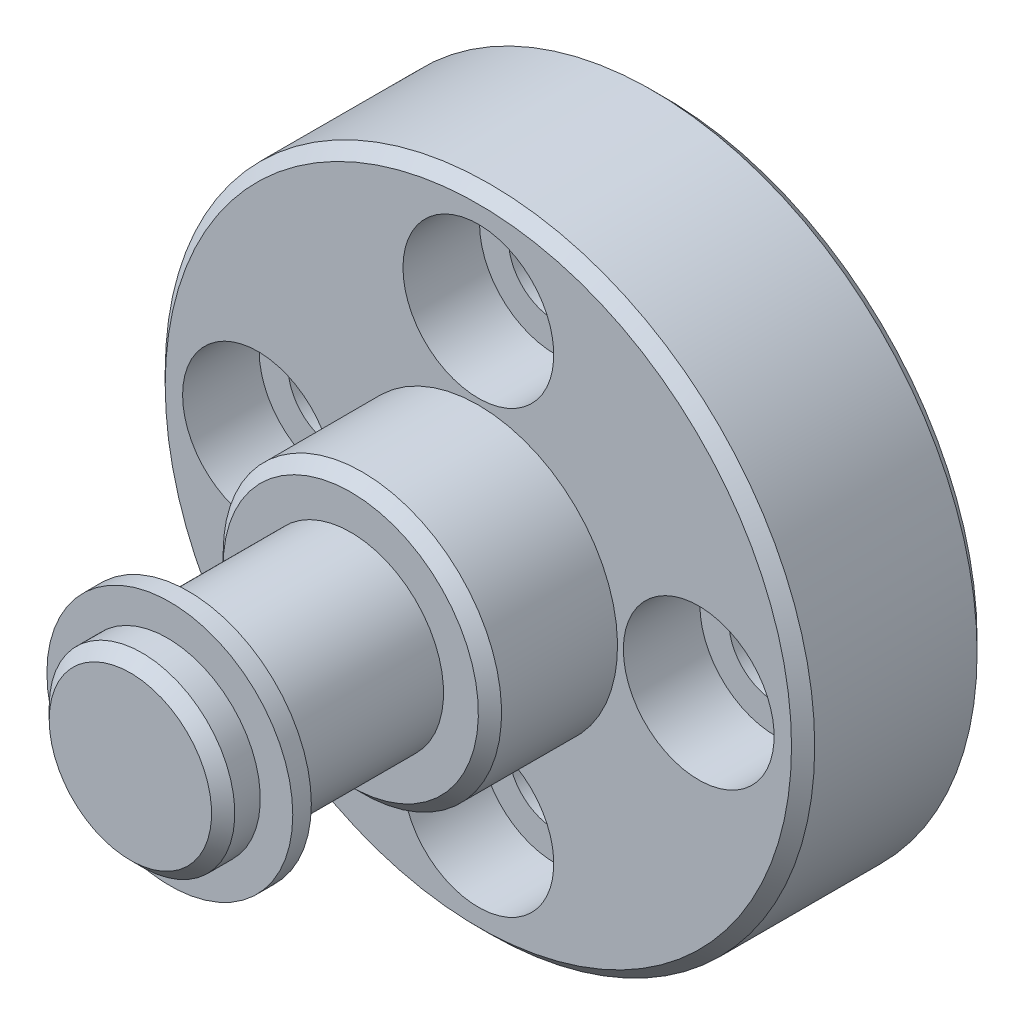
ISO-10303-21;
HEADER;
FILE_DESCRIPTION(('STEP AP214'),'2;1');
FILE_NAME('part.step','',(''),(''),'','','');
FILE_SCHEMA(('AUTOMOTIVE_DESIGN { 1 0 10303 214 1 1 1 1 }'));
ENDSEC;
DATA;
#1=APPLICATION_CONTEXT('core data for automotive mechanical design processes');
#2=APPLICATION_PROTOCOL_DEFINITION('international standard','automotive_design',2000,#1);
#3=PRODUCT_CONTEXT('',#1,'mechanical');
#4=PRODUCT('Part','Part','',(#3));
#5=PRODUCT_RELATED_PRODUCT_CATEGORY('part','',(#4));
#6=PRODUCT_DEFINITION_FORMATION('','',#4);
#7=PRODUCT_DEFINITION_CONTEXT('part definition',#1,'design');
#8=PRODUCT_DEFINITION('design','',#6,#7);
#9=PRODUCT_DEFINITION_SHAPE('','',#8);
#10=(LENGTH_UNIT() NAMED_UNIT(*) SI_UNIT(.MILLI.,.METRE.));
#11=(NAMED_UNIT(*) PLANE_ANGLE_UNIT() SI_UNIT($,.RADIAN.));
#12=(NAMED_UNIT(*) SI_UNIT($,.STERADIAN.) SOLID_ANGLE_UNIT());
#13=UNCERTAINTY_MEASURE_WITH_UNIT(LENGTH_MEASURE(1.E-05),#10,'distance_accuracy_value','');
#14=(GEOMETRIC_REPRESENTATION_CONTEXT(3) GLOBAL_UNCERTAINTY_ASSIGNED_CONTEXT((#13)) GLOBAL_UNIT_ASSIGNED_CONTEXT((#10,
#11,#12)) REPRESENTATION_CONTEXT('',''));
#15=CARTESIAN_POINT('',(0.,0.,0.));
#16=DIRECTION('',(0.,0.,1.));
#17=DIRECTION('',(1.,0.,0.));
#18=AXIS2_PLACEMENT_3D('',#15,#16,#17);
#19=CARTESIAN_POINT('',(5.958,-3.554187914,23.));
#20=DIRECTION('',(0.,0.,1.));
#21=DIRECTION('',(1.,0.,0.));
#22=AXIS2_PLACEMENT_3D('',#19,#20,#21);
#23=PLANE('',#22);
#24=CARTESIAN_POINT('',(9.5,0.,23.));
#25=DIRECTION('',(0.,0.,-1.));
#26=DIRECTION('',(-1.,0.,0.));
#27=AXIS2_PLACEMENT_3D('',#24,#25,#26);
#28=CIRCLE('',#27,3.5);
#29=CARTESIAN_POINT('',(6.,0.,23.));
#30=VERTEX_POINT('',#29);
#31=EDGE_CURVE('E16',#30,#30,#28,.T.);
#32=ORIENTED_EDGE('',*,*,#31,.F.);
#33=EDGE_LOOP('',(#32));
#34=FACE_BOUND('',#33,.T.);
#35=ADVANCED_FACE('F12',(#34),#23,.T.);
#36=CARTESIAN_POINT('',(9.5,0.,23.));
#37=DIRECTION('',(0.,0.,-1.));
#38=DIRECTION('',(-1.,0.,0.));
#39=AXIS2_PLACEMENT_3D('',#36,#37,#38);
#40=CONICAL_SURFACE('',#39,3.5,0.785398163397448);
#41=ORIENTED_EDGE('',*,*,#31,.T.);
#42=EDGE_LOOP('',(#41));
#43=FACE_BOUND('',#42,.T.);
#44=CARTESIAN_POINT('',(9.5,0.,22.5));
#45=DIRECTION('',(0.,0.,-1.));
#46=DIRECTION('',(-1.,0.,0.));
#47=AXIS2_PLACEMENT_3D('',#44,#45,#46);
#48=CIRCLE('',#47,4.);
#49=CARTESIAN_POINT('',(5.5,0.,22.5));
#50=VERTEX_POINT('',#49);
#51=EDGE_CURVE('E28',#50,#50,#48,.T.);
#52=ORIENTED_EDGE('',*,*,#51,.F.);
#53=EDGE_LOOP('',(#52));
#54=FACE_BOUND('',#53,.T.);
#55=ADVANCED_FACE('F114',(#43,#54),#40,.T.);
#56=CARTESIAN_POINT('',(9.5,0.,22.5));
#57=DIRECTION('',(0.,0.,-1.));
#58=DIRECTION('',(-1.,0.,0.));
#59=AXIS2_PLACEMENT_3D('',#56,#57,#58);
#60=CYLINDRICAL_SURFACE('',#59,4.);
#61=ORIENTED_EDGE('',*,*,#51,.T.);
#62=EDGE_LOOP('',(#61));
#63=FACE_BOUND('',#62,.T.);
#64=CARTESIAN_POINT('',(9.5,0.,21.4));
#65=DIRECTION('',(0.,0.,-1.));
#66=DIRECTION('',(-1.,0.,0.));
#67=AXIS2_PLACEMENT_3D('',#64,#65,#66);
#68=CIRCLE('',#67,4.);
#69=CARTESIAN_POINT('',(5.5,0.,21.4));
#70=VERTEX_POINT('',#69);
#71=EDGE_CURVE('E104',#70,#70,#68,.T.);
#72=ORIENTED_EDGE('',*,*,#71,.F.);
#73=EDGE_LOOP('',(#72));
#74=FACE_BOUND('',#73,.T.);
#75=ADVANCED_FACE('F124',(#63,#74),#60,.T.);
#76=CARTESIAN_POINT('',(13.548,-4.061929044,21.4));
#77=DIRECTION('',(0.,0.,-1.));
#78=DIRECTION('',(-1.,0.,0.));
#79=AXIS2_PLACEMENT_3D('',#76,#77,#78);
#80=PLANE('',#79);
#81=CARTESIAN_POINT('',(9.5,0.,21.4));
#82=DIRECTION('',(0.,0.,-1.));
#83=DIRECTION('',(-1.,0.,0.));
#84=AXIS2_PLACEMENT_3D('',#81,#82,#83);
#85=CIRCLE('',#84,3.8);
#86=CARTESIAN_POINT('',(5.7,0.,21.4));
#87=VERTEX_POINT('',#86);
#88=EDGE_CURVE('E102',#87,#87,#85,.T.);
#89=ORIENTED_EDGE('',*,*,#88,.F.);
#90=EDGE_LOOP('',(#89));
#91=FACE_BOUND('',#90,.T.);
#92=ORIENTED_EDGE('',*,*,#71,.T.);
#93=EDGE_LOOP('',(#92));
#94=FACE_BOUND('',#93,.T.);
#95=ADVANCED_FACE('F203',(#91,#94),#80,.T.);
#96=CARTESIAN_POINT('',(9.5,0.,21.4));
#97=DIRECTION('',(0.,0.,-1.));
#98=DIRECTION('',(-1.,0.,0.));
#99=AXIS2_PLACEMENT_3D('',#96,#97,#98);
#100=CYLINDRICAL_SURFACE('',#99,3.8);
#101=ORIENTED_EDGE('',*,*,#88,.T.);
#102=EDGE_LOOP('',(#101));
#103=FACE_BOUND('',#102,.T.);
#104=CARTESIAN_POINT('',(9.5,0.,21.3));
#105=DIRECTION('',(0.,0.,-1.));
#106=DIRECTION('',(-1.,0.,0.));
#107=AXIS2_PLACEMENT_3D('',#104,#105,#106);
#108=CIRCLE('',#107,3.8);
#109=CARTESIAN_POINT('',(5.7,0.,21.3));
#110=VERTEX_POINT('',#109);
#111=EDGE_CURVE('E99',#110,#110,#108,.T.);
#112=ORIENTED_EDGE('',*,*,#111,.F.);
#113=EDGE_LOOP('',(#112));
#114=FACE_BOUND('',#113,.T.);
#115=ADVANCED_FACE('F200',(#103,#114),#100,.T.);
#116=CARTESIAN_POINT('',(4.1364,-5.382055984,21.3));
#117=DIRECTION('',(0.,0.,1.));
#118=DIRECTION('',(1.,0.,0.));
#119=AXIS2_PLACEMENT_3D('',#116,#117,#118);
#120=PLANE('',#119);
#121=ORIENTED_EDGE('',*,*,#111,.T.);
#122=EDGE_LOOP('',(#121));
#123=FACE_BOUND('',#122,.T.);
#124=CARTESIAN_POINT('',(9.5,0.,21.3));
#125=DIRECTION('',(0.,0.,-1.));
#126=DIRECTION('',(-1.,0.,0.));
#127=AXIS2_PLACEMENT_3D('',#124,#125,#126);
#128=CIRCLE('',#127,5.3);
#129=CARTESIAN_POINT('',(4.2,0.,21.3));
#130=VERTEX_POINT('',#129);
#131=EDGE_CURVE('E96',#130,#130,#128,.T.);
#132=ORIENTED_EDGE('',*,*,#131,.F.);
#133=EDGE_LOOP('',(#132));
#134=FACE_BOUND('',#133,.T.);
#135=ADVANCED_FACE('F198',(#123,#134),#120,.T.);
#136=CARTESIAN_POINT('',(9.5,0.,21.3));
#137=DIRECTION('',(0.,0.,-1.));
#138=DIRECTION('',(-1.,0.,0.));
#139=AXIS2_PLACEMENT_3D('',#136,#137,#138);
#140=CYLINDRICAL_SURFACE('',#139,5.3);
#141=ORIENTED_EDGE('',*,*,#131,.T.);
#142=EDGE_LOOP('',(#141));
#143=FACE_BOUND('',#142,.T.);
#144=CARTESIAN_POINT('',(9.5,0.,20.5));
#145=DIRECTION('',(0.,0.,-1.));
#146=DIRECTION('',(-1.,0.,0.));
#147=AXIS2_PLACEMENT_3D('',#144,#145,#146);
#148=CIRCLE('',#147,5.3);
#149=CARTESIAN_POINT('',(4.2,0.,20.5));
#150=VERTEX_POINT('',#149);
#151=EDGE_CURVE('E93',#150,#150,#148,.T.);
#152=ORIENTED_EDGE('',*,*,#151,.F.);
#153=EDGE_LOOP('',(#152));
#154=FACE_BOUND('',#153,.T.);
#155=ADVANCED_FACE('F195',(#143,#154),#140,.T.);
#156=CARTESIAN_POINT('',(14.8636,-5.382055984,20.5));
#157=DIRECTION('',(0.,0.,-1.));
#158=DIRECTION('',(-1.,0.,0.));
#159=AXIS2_PLACEMENT_3D('',#156,#157,#158);
#160=PLANE('',#159);
#161=CARTESIAN_POINT('',(9.5,0.,20.5));
#162=DIRECTION('',(0.,0.,-1.));
#163=DIRECTION('',(-1.,0.,0.));
#164=AXIS2_PLACEMENT_3D('',#161,#162,#163);
#165=CIRCLE('',#164,4.);
#166=CARTESIAN_POINT('',(5.5,0.,20.5));
#167=VERTEX_POINT('',#166);
#168=EDGE_CURVE('E90',#167,#167,#165,.T.);
#169=ORIENTED_EDGE('',*,*,#168,.F.);
#170=EDGE_LOOP('',(#169));
#171=FACE_BOUND('',#170,.T.);
#172=ORIENTED_EDGE('',*,*,#151,.T.);
#173=EDGE_LOOP('',(#172));
#174=FACE_BOUND('',#173,.T.);
#175=ADVANCED_FACE('F193',(#171,#174),#160,.T.);
#176=CARTESIAN_POINT('',(9.5,0.,20.5));
#177=DIRECTION('',(0.,0.,-1.));
#178=DIRECTION('',(-1.,0.,0.));
#179=AXIS2_PLACEMENT_3D('',#176,#177,#178);
#180=CYLINDRICAL_SURFACE('',#179,4.);
#181=ORIENTED_EDGE('',*,*,#168,.T.);
#182=EDGE_LOOP('',(#181));
#183=FACE_BOUND('',#182,.T.);
#184=CARTESIAN_POINT('',(9.5,0.,13.5));
#185=DIRECTION('',(0.,0.,-1.));
#186=DIRECTION('',(-1.,0.,0.));
#187=AXIS2_PLACEMENT_3D('',#184,#185,#186);
#188=CIRCLE('',#187,4.);
#189=CARTESIAN_POINT('',(5.5,0.,13.5));
#190=VERTEX_POINT('',#189);
#191=EDGE_CURVE('E87',#190,#190,#188,.T.);
#192=ORIENTED_EDGE('',*,*,#191,.F.);
#193=EDGE_LOOP('',(#192));
#194=FACE_BOUND('',#193,.T.);
#195=ADVANCED_FACE('F190',(#183,#194),#180,.T.);
#196=CARTESIAN_POINT('',(3.934,-5.585152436,13.5));
#197=DIRECTION('',(0.,0.,1.));
#198=DIRECTION('',(1.,0.,0.));
#199=AXIS2_PLACEMENT_3D('',#196,#197,#198);
#200=PLANE('',#199);
#201=ORIENTED_EDGE('',*,*,#191,.T.);
#202=EDGE_LOOP('',(#201));
#203=FACE_BOUND('',#202,.T.);
#204=CARTESIAN_POINT('',(9.5,0.,13.5));
#205=DIRECTION('',(0.,0.,-1.));
#206=DIRECTION('',(0.,1.,0.));
#207=AXIS2_PLACEMENT_3D('',#204,#205,#206);
#208=CIRCLE('',#207,5.5);
#209=CARTESIAN_POINT('',(9.5,5.5,13.5));
#210=VERTEX_POINT('',#209);
#211=EDGE_CURVE('E83',#210,#210,#208,.T.);
#212=ORIENTED_EDGE('',*,*,#211,.F.);
#213=EDGE_LOOP('',(#212));
#214=FACE_BOUND('',#213,.T.);
#215=ADVANCED_FACE('F188',(#203,#214),#200,.T.);
#216=CARTESIAN_POINT('',(9.5,0.,13.5));
#217=DIRECTION('',(0.,0.,-1.));
#218=DIRECTION('',(0.,1.,0.));
#219=AXIS2_PLACEMENT_3D('',#216,#217,#218);
#220=CONICAL_SURFACE('',#219,5.5,0.78539816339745);
#221=ORIENTED_EDGE('',*,*,#211,.T.);
#222=EDGE_LOOP('',(#221));
#223=FACE_BOUND('',#222,.T.);
#224=CARTESIAN_POINT('',(9.5,0.,13.));
#225=DIRECTION('',(0.,0.,-1.));
#226=DIRECTION('',(-1.,0.,0.));
#227=AXIS2_PLACEMENT_3D('',#224,#225,#226);
#228=CIRCLE('',#227,6.);
#229=CARTESIAN_POINT('',(3.5,0.,13.));
#230=VERTEX_POINT('',#229);
#231=EDGE_CURVE('E86',#230,#230,#228,.T.);
#232=ORIENTED_EDGE('',*,*,#231,.F.);
#233=EDGE_LOOP('',(#232));
#234=FACE_BOUND('',#233,.T.);
#235=ADVANCED_FACE('F184',(#223,#234),#220,.T.);
#236=CARTESIAN_POINT('',(9.5,0.,8.));
#237=DIRECTION('',(0.,0.,-1.));
#238=DIRECTION('',(-1.,0.,0.));
#239=AXIS2_PLACEMENT_3D('',#236,#237,#238);
#240=CONICAL_SURFACE('',#239,13.5,0.785398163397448);
#241=CARTESIAN_POINT('',(9.5,0.,8.));
#242=DIRECTION('',(0.,0.,-1.));
#243=DIRECTION('',(-1.,0.,0.));
#244=AXIS2_PLACEMENT_3D('',#241,#242,#243);
#245=CIRCLE('',#244,13.5);
#246=CARTESIAN_POINT('',(-4.,0.,8.));
#247=VERTEX_POINT('',#246);
#248=EDGE_CURVE('E70',#247,#247,#245,.F.);
#249=ORIENTED_EDGE('',*,*,#248,.F.);
#250=EDGE_LOOP('',(#249));
#251=FACE_BOUND('',#250,.T.);
#252=CARTESIAN_POINT('',(9.5,0.,7.5));
#253=DIRECTION('',(0.,0.,-1.));
#254=DIRECTION('',(-1.,0.,0.));
#255=AXIS2_PLACEMENT_3D('',#252,#253,#254);
#256=CIRCLE('',#255,14.);
#257=CARTESIAN_POINT('',(-4.5,0.,7.5));
#258=VERTEX_POINT('',#257);
#259=EDGE_CURVE('E82',#258,#258,#256,.T.);
#260=ORIENTED_EDGE('',*,*,#259,.F.);
#261=EDGE_LOOP('',(#260));
#262=FACE_BOUND('',#261,.T.);
#263=ADVANCED_FACE('F180',(#251,#262),#240,.T.);
#264=CARTESIAN_POINT('',(9.5,-9.5,8.));
#265=DIRECTION('',(0.,0.,-1.));
#266=DIRECTION('',(-1.,0.,0.));
#267=AXIS2_PLACEMENT_3D('',#264,#265,#266);
#268=CYLINDRICAL_SURFACE('',#267,3.25);
#269=CARTESIAN_POINT('',(9.5,-9.5,4.7));
#270=DIRECTION('',(0.,0.,-1.));
#271=DIRECTION('',(-1.,0.,0.));
#272=AXIS2_PLACEMENT_3D('',#269,#270,#271);
#273=CIRCLE('',#272,3.25);
#274=CARTESIAN_POINT('',(6.25,-9.5,4.7));
#275=VERTEX_POINT('',#274);
#276=EDGE_CURVE('E79',#275,#275,#273,.T.);
#277=ORIENTED_EDGE('',*,*,#276,.T.);
#278=EDGE_LOOP('',(#277));
#279=FACE_BOUND('',#278,.T.);
#280=CARTESIAN_POINT('',(9.5,-9.5,8.));
#281=DIRECTION('',(0.,0.,-1.));
#282=DIRECTION('',(-1.,0.,0.));
#283=AXIS2_PLACEMENT_3D('',#280,#281,#282);
#284=CIRCLE('',#283,3.25);
#285=CARTESIAN_POINT('',(6.25,-9.5,8.));
#286=VERTEX_POINT('',#285);
#287=EDGE_CURVE('E67',#286,#286,#284,.T.);
#288=ORIENTED_EDGE('',*,*,#287,.F.);
#289=EDGE_LOOP('',(#288));
#290=FACE_BOUND('',#289,.T.);
#291=ADVANCED_FACE('F176',(#279,#290),#268,.F.);
#292=CARTESIAN_POINT('',(19.,0.,8.));
#293=DIRECTION('',(0.,0.,-1.));
#294=DIRECTION('',(-1.,0.,0.));
#295=AXIS2_PLACEMENT_3D('',#292,#293,#294);
#296=CYLINDRICAL_SURFACE('',#295,3.25);
#297=CARTESIAN_POINT('',(19.,0.,4.7));
#298=DIRECTION('',(0.,0.,-1.));
#299=DIRECTION('',(-1.,0.,0.));
#300=AXIS2_PLACEMENT_3D('',#297,#298,#299);
#301=CIRCLE('',#300,3.25);
#302=CARTESIAN_POINT('',(15.75,0.,4.7));
#303=VERTEX_POINT('',#302);
#304=EDGE_CURVE('E76',#303,#303,#301,.T.);
#305=ORIENTED_EDGE('',*,*,#304,.T.);
#306=EDGE_LOOP('',(#305));
#307=FACE_BOUND('',#306,.T.);
#308=CARTESIAN_POINT('',(19.,0.,8.));
#309=DIRECTION('',(0.,0.,-1.));
#310=DIRECTION('',(-1.,0.,0.));
#311=AXIS2_PLACEMENT_3D('',#308,#309,#310);
#312=CIRCLE('',#311,3.25);
#313=CARTESIAN_POINT('',(15.75,0.,8.));
#314=VERTEX_POINT('',#313);
#315=EDGE_CURVE('E64',#314,#314,#312,.T.);
#316=ORIENTED_EDGE('',*,*,#315,.F.);
#317=EDGE_LOOP('',(#316));
#318=FACE_BOUND('',#317,.T.);
#319=ADVANCED_FACE('F172',(#307,#318),#296,.F.);
#320=CARTESIAN_POINT('',(9.5,9.5,8.));
#321=DIRECTION('',(0.,0.,-1.));
#322=DIRECTION('',(-1.,0.,0.));
#323=AXIS2_PLACEMENT_3D('',#320,#321,#322);
#324=CYLINDRICAL_SURFACE('',#323,3.25);
#325=CARTESIAN_POINT('',(9.5,9.5,4.7));
#326=DIRECTION('',(0.,0.,-1.));
#327=DIRECTION('',(-1.,0.,0.));
#328=AXIS2_PLACEMENT_3D('',#325,#326,#327);
#329=CIRCLE('',#328,3.25);
#330=CARTESIAN_POINT('',(6.25,9.5,4.7));
#331=VERTEX_POINT('',#330);
#332=EDGE_CURVE('E73',#331,#331,#329,.T.);
#333=ORIENTED_EDGE('',*,*,#332,.T.);
#334=EDGE_LOOP('',(#333));
#335=FACE_BOUND('',#334,.T.);
#336=CARTESIAN_POINT('',(9.5,9.5,8.));
#337=DIRECTION('',(0.,0.,-1.));
#338=DIRECTION('',(-1.,0.,0.));
#339=AXIS2_PLACEMENT_3D('',#336,#337,#338);
#340=CIRCLE('',#339,3.25);
#341=CARTESIAN_POINT('',(6.25,9.5,8.));
#342=VERTEX_POINT('',#341);
#343=EDGE_CURVE('E61',#342,#342,#340,.T.);
#344=ORIENTED_EDGE('',*,*,#343,.F.);
#345=EDGE_LOOP('',(#344));
#346=FACE_BOUND('',#345,.T.);
#347=ADVANCED_FACE('F168',(#335,#346),#324,.F.);
#348=CARTESIAN_POINT('',(9.5,0.,13.));
#349=DIRECTION('',(0.,0.,-1.));
#350=DIRECTION('',(0.,1.,0.));
#351=AXIS2_PLACEMENT_3D('',#348,#349,#350);
#352=CYLINDRICAL_SURFACE('',#351,6.);
#353=ORIENTED_EDGE('',*,*,#231,.T.);
#354=EDGE_LOOP('',(#353));
#355=FACE_BOUND('',#354,.T.);
#356=CARTESIAN_POINT('',(9.5,0.,8.));
#357=DIRECTION('',(0.,0.,-1.));
#358=DIRECTION('',(0.,1.,0.));
#359=AXIS2_PLACEMENT_3D('',#356,#357,#358);
#360=CIRCLE('',#359,6.);
#361=CARTESIAN_POINT('',(9.5,6.,8.));
#362=VERTEX_POINT('',#361);
#363=EDGE_CURVE('E58',#362,#362,#360,.T.);
#364=ORIENTED_EDGE('',*,*,#363,.F.);
#365=EDGE_LOOP('',(#364));
#366=FACE_BOUND('',#365,.T.);
#367=ADVANCED_FACE('F164',(#355,#366),#352,.T.);
#368=CARTESIAN_POINT('',(9.5,0.,7.5));
#369=DIRECTION('',(0.,0.,-1.));
#370=DIRECTION('',(0.,1.,0.));
#371=AXIS2_PLACEMENT_3D('',#368,#369,#370);
#372=CYLINDRICAL_SURFACE('',#371,14.);
#373=CARTESIAN_POINT('',(9.5,0.,0.499999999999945));
#374=DIRECTION('',(0.,0.,1.));
#375=DIRECTION('',(1.,0.,0.));
#376=AXIS2_PLACEMENT_3D('',#373,#374,#375);
#377=CIRCLE('',#376,14.);
#378=CARTESIAN_POINT('',(23.5,0.,0.5));
#379=VERTEX_POINT('',#378);
#380=EDGE_CURVE('E57',#379,#379,#377,.F.);
#381=ORIENTED_EDGE('',*,*,#380,.F.);
#382=EDGE_LOOP('',(#381));
#383=FACE_BOUND('',#382,.T.);
#384=ORIENTED_EDGE('',*,*,#259,.T.);
#385=EDGE_LOOP('',(#384));
#386=FACE_BOUND('',#385,.T.);
#387=ADVANCED_FACE('F160',(#383,#386),#372,.T.);
#388=CARTESIAN_POINT('',(6.211,-6.199682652,4.7));
#389=DIRECTION('',(0.,0.,-1.));
#390=DIRECTION('',(1.,0.,0.));
#391=AXIS2_PLACEMENT_3D('',#388,#389,#390);
#392=PLANE('',#391);
#393=CARTESIAN_POINT('',(9.5,-9.5,4.7));
#394=DIRECTION('',(0.,0.,-1.));
#395=DIRECTION('',(-1.,0.,0.));
#396=AXIS2_PLACEMENT_3D('',#393,#394,#395);
#397=CIRCLE('',#396,2.);
#398=CARTESIAN_POINT('',(7.5,-9.5,4.7));
#399=VERTEX_POINT('',#398);
#400=EDGE_CURVE('E54',#399,#399,#397,.T.);
#401=ORIENTED_EDGE('',*,*,#400,.T.);
#402=EDGE_LOOP('',(#401));
#403=FACE_BOUND('',#402,.T.);
#404=ORIENTED_EDGE('',*,*,#276,.F.);
#405=EDGE_LOOP('',(#404));
#406=FACE_BOUND('',#405,.T.);
#407=ADVANCED_FACE('F163',(#403,#406),#392,.F.);
#408=CARTESIAN_POINT('',(15.699682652,-3.289,4.7));
#409=DIRECTION('',(0.,0.,-1.));
#410=DIRECTION('',(0.,1.,0.));
#411=AXIS2_PLACEMENT_3D('',#408,#409,#410);
#412=PLANE('',#411);
#413=CARTESIAN_POINT('',(19.,0.,4.7));
#414=DIRECTION('',(0.,0.,-1.));
#415=DIRECTION('',(-1.,0.,0.));
#416=AXIS2_PLACEMENT_3D('',#413,#414,#415);
#417=CIRCLE('',#416,2.);
#418=CARTESIAN_POINT('',(17.,0.,4.7));
#419=VERTEX_POINT('',#418);
#420=EDGE_CURVE('E51',#419,#419,#417,.T.);
#421=ORIENTED_EDGE('',*,*,#420,.T.);
#422=EDGE_LOOP('',(#421));
#423=FACE_BOUND('',#422,.T.);
#424=ORIENTED_EDGE('',*,*,#304,.F.);
#425=EDGE_LOOP('',(#424));
#426=FACE_BOUND('',#425,.T.);
#427=ADVANCED_FACE('F228',(#423,#426),#412,.F.);
#428=CARTESIAN_POINT('',(12.789,6.199682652,4.7));
#429=DIRECTION('',(0.,0.,-1.));
#430=DIRECTION('',(-1.,0.,0.));
#431=AXIS2_PLACEMENT_3D('',#428,#429,#430);
#432=PLANE('',#431);
#433=CARTESIAN_POINT('',(9.5,9.5,4.7));
#434=DIRECTION('',(0.,0.,-1.));
#435=DIRECTION('',(-1.,0.,0.));
#436=AXIS2_PLACEMENT_3D('',#433,#434,#435);
#437=CIRCLE('',#436,2.);
#438=CARTESIAN_POINT('',(7.5,9.5,4.7));
#439=VERTEX_POINT('',#438);
#440=EDGE_CURVE('E48',#439,#439,#437,.T.);
#441=ORIENTED_EDGE('',*,*,#440,.T.);
#442=EDGE_LOOP('',(#441));
#443=FACE_BOUND('',#442,.T.);
#444=ORIENTED_EDGE('',*,*,#332,.F.);
#445=EDGE_LOOP('',(#444));
#446=FACE_BOUND('',#445,.T.);
#447=ADVANCED_FACE('F232',(#443,#446),#432,.F.);
#448=CARTESIAN_POINT('',(-4.162,-13.709010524,8.));
#449=DIRECTION('',(0.,0.,1.));
#450=DIRECTION('',(1.,0.,0.));
#451=AXIS2_PLACEMENT_3D('',#448,#449,#450);
#452=PLANE('',#451);
#453=ORIENTED_EDGE('',*,*,#363,.T.);
#454=EDGE_LOOP('',(#453));
#455=FACE_BOUND('',#454,.T.);
#456=ORIENTED_EDGE('',*,*,#343,.T.);
#457=EDGE_LOOP('',(#456));
#458=FACE_BOUND('',#457,.T.);
#459=ORIENTED_EDGE('',*,*,#315,.T.);
#460=EDGE_LOOP('',(#459));
#461=FACE_BOUND('',#460,.T.);
#462=ORIENTED_EDGE('',*,*,#287,.T.);
#463=EDGE_LOOP('',(#462));
#464=FACE_BOUND('',#463,.T.);
#465=CARTESIAN_POINT('',(0.,0.,8.));
#466=DIRECTION('',(0.,0.,-1.));
#467=DIRECTION('',(-1.,0.,0.));
#468=AXIS2_PLACEMENT_3D('',#465,#466,#467);
#469=CIRCLE('',#468,3.25);
#470=CARTESIAN_POINT('',(-3.25,0.,8.));
#471=VERTEX_POINT('',#470);
#472=EDGE_CURVE('E45',#471,#471,#469,.T.);
#473=ORIENTED_EDGE('',*,*,#472,.T.);
#474=EDGE_LOOP('',(#473));
#475=FACE_BOUND('',#474,.T.);
#476=ORIENTED_EDGE('',*,*,#248,.T.);
#477=EDGE_LOOP('',(#476));
#478=FACE_BOUND('',#477,.T.);
#479=ADVANCED_FACE('F158',(#455,#458,#461,#464,#475,#478),#452,.T.);
#480=CARTESIAN_POINT('',(9.5,0.,0.));
#481=DIRECTION('',(0.,0.,1.));
#482=DIRECTION('',(1.,0.,0.));
#483=AXIS2_PLACEMENT_3D('',#480,#481,#482);
#484=CONICAL_SURFACE('',#483,13.5,0.785398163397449);
#485=ORIENTED_EDGE('',*,*,#380,.T.);
#486=EDGE_LOOP('',(#485));
#487=FACE_BOUND('',#486,.T.);
#488=CARTESIAN_POINT('',(9.5,0.,0.));
#489=DIRECTION('',(0.,0.,1.));
#490=DIRECTION('',(1.,0.,0.));
#491=AXIS2_PLACEMENT_3D('',#488,#489,#490);
#492=CIRCLE('',#491,13.5);
#493=CARTESIAN_POINT('',(23.,0.,0.));
#494=VERTEX_POINT('',#493);
#495=EDGE_CURVE('E42',#494,#494,#492,.F.);
#496=ORIENTED_EDGE('',*,*,#495,.F.);
#497=EDGE_LOOP('',(#496));
#498=FACE_BOUND('',#497,.T.);
#499=ADVANCED_FACE('F154',(#487,#498),#484,.T.);
#500=CARTESIAN_POINT('',(9.5,-9.5,4.7));
#501=DIRECTION('',(0.,0.,-1.));
#502=DIRECTION('',(-1.,0.,0.));
#503=AXIS2_PLACEMENT_3D('',#500,#501,#502);
#504=CYLINDRICAL_SURFACE('',#503,2.);
#505=CARTESIAN_POINT('',(9.5,-9.5,0.));
#506=DIRECTION('',(0.,0.,-1.));
#507=DIRECTION('',(-1.,0.,0.));
#508=AXIS2_PLACEMENT_3D('',#505,#506,#507);
#509=CIRCLE('',#508,2.);
#510=CARTESIAN_POINT('',(7.5,-9.5,0.));
#511=VERTEX_POINT('',#510);
#512=EDGE_CURVE('E39',#511,#511,#509,.F.);
#513=ORIENTED_EDGE('',*,*,#512,.F.);
#514=EDGE_LOOP('',(#513));
#515=FACE_BOUND('',#514,.T.);
#516=ORIENTED_EDGE('',*,*,#400,.F.);
#517=EDGE_LOOP('',(#516));
#518=FACE_BOUND('',#517,.T.);
#519=ADVANCED_FACE('F150',(#515,#518),#504,.F.);
#520=CARTESIAN_POINT('',(19.,0.,4.7));
#521=DIRECTION('',(0.,0.,-1.));
#522=DIRECTION('',(-1.,0.,0.));
#523=AXIS2_PLACEMENT_3D('',#520,#521,#522);
#524=CYLINDRICAL_SURFACE('',#523,2.);
#525=CARTESIAN_POINT('',(19.,0.,0.));
#526=DIRECTION('',(0.,0.,-1.));
#527=DIRECTION('',(-1.,0.,0.));
#528=AXIS2_PLACEMENT_3D('',#525,#526,#527);
#529=CIRCLE('',#528,2.);
#530=CARTESIAN_POINT('',(17.,0.,0.));
#531=VERTEX_POINT('',#530);
#532=EDGE_CURVE('E36',#531,#531,#529,.F.);
#533=ORIENTED_EDGE('',*,*,#532,.F.);
#534=EDGE_LOOP('',(#533));
#535=FACE_BOUND('',#534,.T.);
#536=ORIENTED_EDGE('',*,*,#420,.F.);
#537=EDGE_LOOP('',(#536));
#538=FACE_BOUND('',#537,.T.);
#539=ADVANCED_FACE('F146',(#535,#538),#524,.F.);
#540=CARTESIAN_POINT('',(9.5,9.5,4.7));
#541=DIRECTION('',(0.,0.,-1.));
#542=DIRECTION('',(-1.,0.,0.));
#543=AXIS2_PLACEMENT_3D('',#540,#541,#542);
#544=CYLINDRICAL_SURFACE('',#543,2.);
#545=CARTESIAN_POINT('',(9.5,9.5,0.));
#546=DIRECTION('',(0.,0.,-1.));
#547=DIRECTION('',(-1.,0.,0.));
#548=AXIS2_PLACEMENT_3D('',#545,#546,#547);
#549=CIRCLE('',#548,2.);
#550=CARTESIAN_POINT('',(7.5,9.5,0.));
#551=VERTEX_POINT('',#550);
#552=EDGE_CURVE('E33',#551,#551,#549,.F.);
#553=ORIENTED_EDGE('',*,*,#552,.F.);
#554=EDGE_LOOP('',(#553));
#555=FACE_BOUND('',#554,.T.);
#556=ORIENTED_EDGE('',*,*,#440,.F.);
#557=EDGE_LOOP('',(#556));
#558=FACE_BOUND('',#557,.T.);
#559=ADVANCED_FACE('F142',(#555,#558),#544,.F.);
#560=CARTESIAN_POINT('',(0.,0.,8.));
#561=DIRECTION('',(0.,0.,-1.));
#562=DIRECTION('',(-1.,0.,0.));
#563=AXIS2_PLACEMENT_3D('',#560,#561,#562);
#564=CYLINDRICAL_SURFACE('',#563,3.25);
#565=ORIENTED_EDGE('',*,*,#472,.F.);
#566=EDGE_LOOP('',(#565));
#567=FACE_BOUND('',#566,.T.);
#568=CARTESIAN_POINT('',(0.,0.,4.7));
#569=DIRECTION('',(0.,0.,-1.));
#570=DIRECTION('',(-1.,0.,0.));
#571=AXIS2_PLACEMENT_3D('',#568,#569,#570);
#572=CIRCLE('',#571,3.25);
#573=CARTESIAN_POINT('',(-3.25,0.,4.7));
#574=VERTEX_POINT('',#573);
#575=EDGE_CURVE('E25',#574,#574,#572,.T.);
#576=ORIENTED_EDGE('',*,*,#575,.T.);
#577=EDGE_LOOP('',(#576));
#578=FACE_BOUND('',#577,.T.);
#579=ADVANCED_FACE('F139',(#567,#578),#564,.F.);
#580=CARTESIAN_POINT('',(23.162,-13.709010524,0.));
#581=DIRECTION('',(0.,0.,-1.));
#582=DIRECTION('',(-1.,0.,0.));
#583=AXIS2_PLACEMENT_3D('',#580,#581,#582);
#584=PLANE('',#583);
#585=ORIENTED_EDGE('',*,*,#552,.T.);
#586=EDGE_LOOP('',(#585));
#587=FACE_BOUND('',#586,.T.);
#588=ORIENTED_EDGE('',*,*,#532,.T.);
#589=EDGE_LOOP('',(#588));
#590=FACE_BOUND('',#589,.T.);
#591=ORIENTED_EDGE('',*,*,#512,.T.);
#592=EDGE_LOOP('',(#591));
#593=FACE_BOUND('',#592,.T.);
#594=CARTESIAN_POINT('',(0.,0.,0.));
#595=DIRECTION('',(0.,0.,-1.));
#596=DIRECTION('',(-1.,0.,0.));
#597=AXIS2_PLACEMENT_3D('',#594,#595,#596);
#598=CIRCLE('',#597,2.);
#599=CARTESIAN_POINT('',(-2.,0.,0.));
#600=VERTEX_POINT('',#599);
#601=EDGE_CURVE('E20',#600,#600,#598,.F.);
#602=ORIENTED_EDGE('',*,*,#601,.T.);
#603=EDGE_LOOP('',(#602));
#604=FACE_BOUND('',#603,.T.);
#605=ORIENTED_EDGE('',*,*,#495,.T.);
#606=EDGE_LOOP('',(#605));
#607=FACE_BOUND('',#606,.T.);
#608=ADVANCED_FACE('F135',(#587,#590,#593,#604,#607),#584,.T.);
#609=CARTESIAN_POINT('',(3.300317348,3.289,4.7));
#610=DIRECTION('',(0.,0.,-1.));
#611=DIRECTION('',(0.,-1.,0.));
#612=AXIS2_PLACEMENT_3D('',#609,#610,#611);
#613=PLANE('',#612);
#614=CARTESIAN_POINT('',(0.,0.,4.7));
#615=DIRECTION('',(0.,0.,-1.));
#616=DIRECTION('',(-1.,0.,0.));
#617=AXIS2_PLACEMENT_3D('',#614,#615,#616);
#618=CIRCLE('',#617,2.);
#619=CARTESIAN_POINT('',(-2.,0.,4.7));
#620=VERTEX_POINT('',#619);
#621=EDGE_CURVE('E8',#620,#620,#618,.T.);
#622=ORIENTED_EDGE('',*,*,#621,.T.);
#623=EDGE_LOOP('',(#622));
#624=FACE_BOUND('',#623,.T.);
#625=ORIENTED_EDGE('',*,*,#575,.F.);
#626=EDGE_LOOP('',(#625));
#627=FACE_BOUND('',#626,.T.);
#628=ADVANCED_FACE('F14',(#624,#627),#613,.F.);
#629=CARTESIAN_POINT('',(0.,0.,4.7));
#630=DIRECTION('',(0.,0.,-1.));
#631=DIRECTION('',(-1.,0.,0.));
#632=AXIS2_PLACEMENT_3D('',#629,#630,#631);
#633=CYLINDRICAL_SURFACE('',#632,2.);
#634=ORIENTED_EDGE('',*,*,#601,.F.);
#635=EDGE_LOOP('',(#634));
#636=FACE_BOUND('',#635,.T.);
#637=ORIENTED_EDGE('',*,*,#621,.F.);
#638=EDGE_LOOP('',(#637));
#639=FACE_BOUND('',#638,.T.);
#640=ADVANCED_FACE('F128',(#636,#639),#633,.F.);
#641=CLOSED_SHELL('',(#35,#55,#75,#95,#115,#135,#155,#175,#195,#215,#235,#263,#291,#319,#347,
#367,#387,#407,#427,#447,#479,#499,#519,#539,#559,#579,#608,#628,#640));
#642=MANIFOLD_SOLID_BREP('B1',#641);
#643=ADVANCED_BREP_SHAPE_REPRESENTATION('',(#18,#642),#14);
#644=SHAPE_DEFINITION_REPRESENTATION(#9,#643);
ENDSEC;
END-ISO-10303-21;
